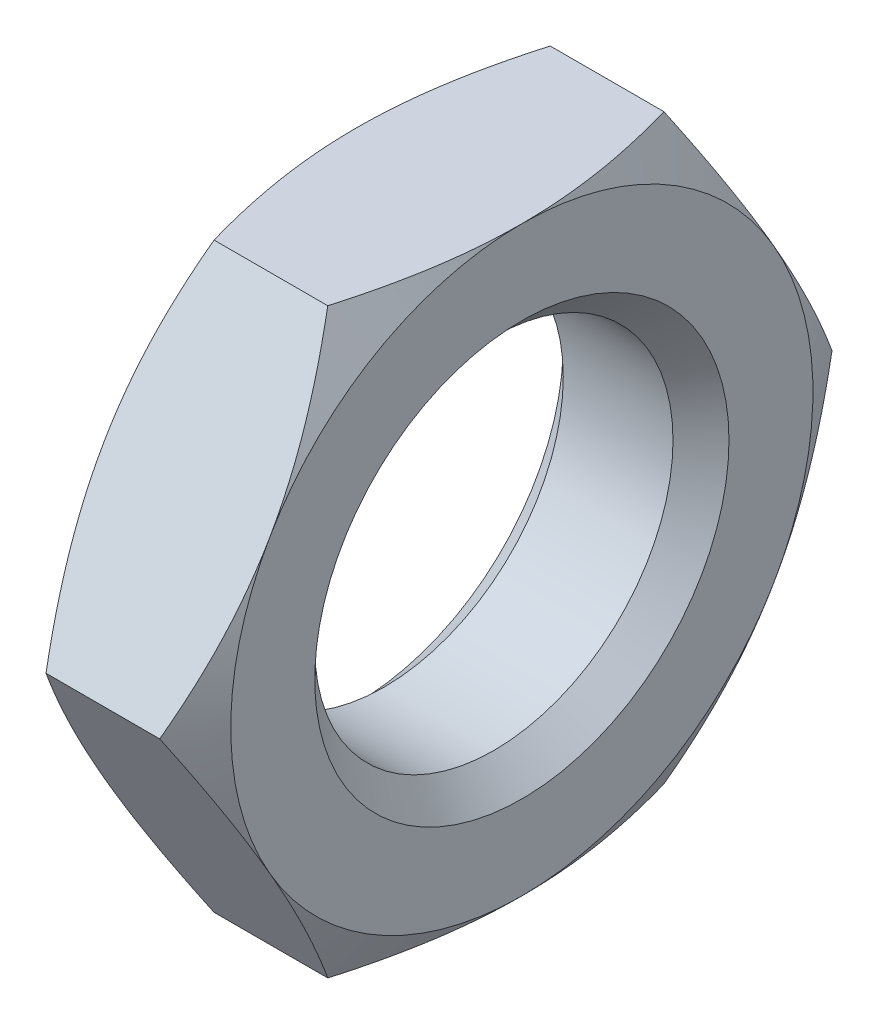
ISO-10303-21;
HEADER;
FILE_DESCRIPTION(('STEP AP214'),'2;1');
FILE_NAME('part.step','',(''),(''),'','','');
FILE_SCHEMA(('AUTOMOTIVE_DESIGN { 1 0 10303 214 1 1 1 1 }'));
ENDSEC;
DATA;
#1=APPLICATION_CONTEXT('core data for automotive mechanical design processes');
#2=APPLICATION_PROTOCOL_DEFINITION('international standard','automotive_design',2000,#1);
#3=PRODUCT_CONTEXT('',#1,'mechanical');
#4=PRODUCT('Part','Part','',(#3));
#5=PRODUCT_RELATED_PRODUCT_CATEGORY('part','',(#4));
#6=PRODUCT_DEFINITION_FORMATION('','',#4);
#7=PRODUCT_DEFINITION_CONTEXT('part definition',#1,'design');
#8=PRODUCT_DEFINITION('design','',#6,#7);
#9=PRODUCT_DEFINITION_SHAPE('','',#8);
#10=(LENGTH_UNIT() NAMED_UNIT(*) SI_UNIT(.MILLI.,.METRE.));
#11=(NAMED_UNIT(*) PLANE_ANGLE_UNIT() SI_UNIT($,.RADIAN.));
#12=(NAMED_UNIT(*) SI_UNIT($,.STERADIAN.) SOLID_ANGLE_UNIT());
#13=UNCERTAINTY_MEASURE_WITH_UNIT(LENGTH_MEASURE(1.E-05),#10,'distance_accuracy_value','');
#14=(GEOMETRIC_REPRESENTATION_CONTEXT(3) GLOBAL_UNCERTAINTY_ASSIGNED_CONTEXT((#13)) GLOBAL_UNIT_ASSIGNED_CONTEXT((#10,
#11,#12)) REPRESENTATION_CONTEXT('',''));
#15=CARTESIAN_POINT('',(0.,0.,0.));
#16=DIRECTION('',(0.,0.,1.));
#17=DIRECTION('',(1.,0.,0.));
#18=AXIS2_PLACEMENT_3D('',#15,#16,#17);
#19=CARTESIAN_POINT('',(3.7,6.5,-3.75277674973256));
#20=DIRECTION('',(1.,0.,0.));
#21=DIRECTION('',(0.,0.,-1.));
#22=AXIS2_PLACEMENT_3D('',#19,#20,#21);
#23=PLANE('',#22);
#24=CARTESIAN_POINT('',(3.7,0.,0.));
#25=DIRECTION('',(1.,0.,0.));
#26=DIRECTION('',(0.,0.,-1.));
#27=AXIS2_PLACEMENT_3D('',#24,#25,#26);
#28=CIRCLE('',#27,4.625);
#29=CARTESIAN_POINT('',(3.7,0.,-4.625));
#30=VERTEX_POINT('',#29);
#31=EDGE_CURVE('E11',#30,#30,#28,.F.);
#32=ORIENTED_EDGE('',*,*,#31,.T.);
#33=EDGE_LOOP('',(#32));
#34=FACE_BOUND('',#33,.T.);
#35=CARTESIAN_POINT('',(3.7,0.,0.));
#36=DIRECTION('',(1.,0.,0.));
#37=DIRECTION('',(0.,0.,-1.));
#38=AXIS2_PLACEMENT_3D('',#35,#36,#37);
#39=CIRCLE('',#38,6.5);
#40=CARTESIAN_POINT('',(3.7,-6.5,0.));
#41=VERTEX_POINT('',#40);
#42=CARTESIAN_POINT('',(3.7,-3.25,-5.62916512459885));
#43=VERTEX_POINT('',#42);
#44=EDGE_CURVE('E142',#41,#43,#39,.T.);
#45=ORIENTED_EDGE('',*,*,#44,.T.);
#46=CARTESIAN_POINT('',(3.7,3.25,-5.62916512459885));
#47=VERTEX_POINT('',#46);
#48=EDGE_CURVE('E130',#43,#47,#39,.T.);
#49=ORIENTED_EDGE('',*,*,#48,.T.);
#50=CARTESIAN_POINT('',(3.7,6.5,0.));
#51=VERTEX_POINT('',#50);
#52=EDGE_CURVE('E144',#47,#51,#39,.T.);
#53=ORIENTED_EDGE('',*,*,#52,.T.);
#54=CARTESIAN_POINT('',(3.7,3.25,5.62916512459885));
#55=VERTEX_POINT('',#54);
#56=EDGE_CURVE('E55',#51,#55,#39,.T.);
#57=ORIENTED_EDGE('',*,*,#56,.T.);
#58=CARTESIAN_POINT('',(3.7,-3.25,5.62916512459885));
#59=VERTEX_POINT('',#58);
#60=EDGE_CURVE('E63',#55,#59,#39,.T.);
#61=ORIENTED_EDGE('',*,*,#60,.T.);
#62=EDGE_CURVE('E166',#59,#41,#39,.T.);
#63=ORIENTED_EDGE('',*,*,#62,.T.);
#64=EDGE_LOOP('',(#45,#49,#53,#57,#61,#63));
#65=FACE_BOUND('',#64,.T.);
#66=ADVANCED_FACE('F39',(#34,#65),#23,.T.);
#67=CARTESIAN_POINT('',(0.,6.5,-3.75277674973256));
#68=DIRECTION('',(1.,0.,0.));
#69=DIRECTION('',(0.,0.,-1.));
#70=AXIS2_PLACEMENT_3D('',#67,#68,#69);
#71=PLANE('',#70);
#72=CARTESIAN_POINT('',(0.,0.,0.));
#73=DIRECTION('',(1.,0.,0.));
#74=DIRECTION('',(0.,0.,-1.));
#75=AXIS2_PLACEMENT_3D('',#72,#73,#74);
#76=CIRCLE('',#75,4.625);
#77=CARTESIAN_POINT('',(0.,0.,4.625));
#78=VERTEX_POINT('',#77);
#79=EDGE_CURVE('E164',#78,#78,#76,.T.);
#80=ORIENTED_EDGE('',*,*,#79,.T.);
#81=EDGE_LOOP('',(#80));
#82=FACE_BOUND('',#81,.T.);
#83=CARTESIAN_POINT('',(0.,0.,0.));
#84=DIRECTION('',(1.,0.,0.));
#85=DIRECTION('',(0.,0.,-1.));
#86=AXIS2_PLACEMENT_3D('',#83,#84,#85);
#87=CIRCLE('',#86,6.5);
#88=CARTESIAN_POINT('',(0.,-3.25,-5.62916512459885));
#89=VERTEX_POINT('',#88);
#90=CARTESIAN_POINT('',(0.,3.25,-5.62916512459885));
#91=VERTEX_POINT('',#90);
#92=EDGE_CURVE('E173',#89,#91,#87,.T.);
#93=ORIENTED_EDGE('',*,*,#92,.F.);
#94=CARTESIAN_POINT('',(0.,-6.5,0.));
#95=VERTEX_POINT('',#94);
#96=EDGE_CURVE('E318',#95,#89,#87,.T.);
#97=ORIENTED_EDGE('',*,*,#96,.F.);
#98=CARTESIAN_POINT('',(0.,-3.25,5.62916512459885));
#99=VERTEX_POINT('',#98);
#100=EDGE_CURVE('E321',#99,#95,#87,.T.);
#101=ORIENTED_EDGE('',*,*,#100,.F.);
#102=CARTESIAN_POINT('',(0.,3.25,5.62916512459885));
#103=VERTEX_POINT('',#102);
#104=EDGE_CURVE('E327',#103,#99,#87,.T.);
#105=ORIENTED_EDGE('',*,*,#104,.F.);
#106=CARTESIAN_POINT('',(0.,6.5,0.));
#107=VERTEX_POINT('',#106);
#108=EDGE_CURVE('E178',#107,#103,#87,.T.);
#109=ORIENTED_EDGE('',*,*,#108,.F.);
#110=EDGE_CURVE('E174',#91,#107,#87,.T.);
#111=ORIENTED_EDGE('',*,*,#110,.F.);
#112=EDGE_LOOP('',(#93,#97,#101,#105,#109,#111));
#113=FACE_BOUND('',#112,.T.);
#114=ADVANCED_FACE('F319',(#82,#113),#71,.F.);
#115=CARTESIAN_POINT('',(3.7,0.,0.));
#116=DIRECTION('',(-1.,0.,0.));
#117=DIRECTION('',(0.,0.,1.));
#118=AXIS2_PLACEMENT_3D('',#115,#116,#117);
#119=CYLINDRICAL_SURFACE('',#118,4.);
#120=CARTESIAN_POINT('',(0.625000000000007,0.,0.));
#121=DIRECTION('',(1.,0.,0.));
#122=DIRECTION('',(0.,0.,-1.));
#123=AXIS2_PLACEMENT_3D('',#120,#121,#122);
#124=CIRCLE('',#123,4.);
#125=CARTESIAN_POINT('',(0.625000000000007,0.,4.));
#126=VERTEX_POINT('',#125);
#127=EDGE_CURVE('E48',#126,#126,#124,.F.);
#128=ORIENTED_EDGE('',*,*,#127,.T.);
#129=EDGE_LOOP('',(#128));
#130=FACE_BOUND('',#129,.T.);
#131=CARTESIAN_POINT('',(3.075,0.,0.));
#132=DIRECTION('',(1.,0.,0.));
#133=DIRECTION('',(0.,0.,-1.));
#134=AXIS2_PLACEMENT_3D('',#131,#132,#133);
#135=CIRCLE('',#134,4.);
#136=CARTESIAN_POINT('',(3.075,0.,-4.));
#137=VERTEX_POINT('',#136);
#138=EDGE_CURVE('E410',#137,#137,#135,.T.);
#139=ORIENTED_EDGE('',*,*,#138,.T.);
#140=EDGE_LOOP('',(#139));
#141=FACE_BOUND('',#140,.T.);
#142=ADVANCED_FACE('F234',(#130,#141),#119,.F.);
#143=CARTESIAN_POINT('',(0.,0.,0.));
#144=DIRECTION('',(1.,0.,0.));
#145=DIRECTION('',(0.,0.,-1.));
#146=AXIS2_PLACEMENT_3D('',#143,#144,#145);
#147=CONICAL_SURFACE('',#146,6.5,1.0471975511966);
#148=CARTESIAN_POINT('',(0.580623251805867,-6.5002,-3.75266127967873));
#149=CARTESIAN_POINT('',(0.533004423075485,-6.35732254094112,-3.8351516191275));
#150=CARTESIAN_POINT('',(0.487546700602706,-6.21391236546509,-3.91794952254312));
#151=CARTESIAN_POINT('',(0.401548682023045,-5.9259273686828,-4.08421773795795));
#152=CARTESIAN_POINT('',(0.361010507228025,-5.78135207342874,-4.16768832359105));
#153=CARTESIAN_POINT('',(0.247571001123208,-5.34531134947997,-4.41943655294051));
#154=CARTESIAN_POINT('',(0.183047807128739,-5.05212471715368,-4.58870793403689));
#155=CARTESIAN_POINT('',(0.107386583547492,-4.61337625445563,-4.84201947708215));
#156=CARTESIAN_POINT('',(0.0858328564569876,-4.46912536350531,-4.92530276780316));
#157=CARTESIAN_POINT('',(0.0496903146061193,-4.17997178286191,-5.09224566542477));
#158=CARTESIAN_POINT('',(0.0351008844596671,-4.03506915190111,-5.17590523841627));
#159=CARTESIAN_POINT('',(0.0132587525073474,-3.74501222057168,-5.34336968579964));
#160=CARTESIAN_POINT('',(0.00599772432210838,-3.59985839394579,-5.427174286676));
#161=CARTESIAN_POINT('',(-0.00103969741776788,-3.30942466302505,-5.59485627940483));
#162=CARTESIAN_POINT('',(-0.00081632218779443,-3.16414476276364,-5.6787336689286));
#163=CARTESIAN_POINT('',(0.0100834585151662,-2.76612405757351,-5.90853103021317));
#164=CARTESIAN_POINT('',(0.0283818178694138,-2.51351353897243,-6.05437578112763));
#165=CARTESIAN_POINT('',(0.0864063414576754,-2.00997032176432,-6.34509659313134));
#166=CARTESIAN_POINT('',(0.126152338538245,-1.75903939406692,-6.48997163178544));
#167=CARTESIAN_POINT('',(0.22550590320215,-1.25448277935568,-6.78127752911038));
#168=CARTESIAN_POINT('',(0.285534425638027,-1.00092075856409,-6.92767163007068));
#169=CARTESIAN_POINT('',(0.421774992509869,-0.497578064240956,-7.21827667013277));
#170=CARTESIAN_POINT('',(0.497955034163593,-0.247790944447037,-7.36249133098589));
#171=CARTESIAN_POINT('',(0.580623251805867,0.000199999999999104,-7.50566896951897));
#172=B_SPLINE_CURVE_WITH_KNOTS('',3,(#148,#149,#150,#151,#152,#153,#154,#155,#156,#157,#158,
#159,#160,#161,#162,#163,#164,#165,#166,#167,#168,#169,#170,#171),.UNSPECIFIED.,.F.,.F.,(4,2,2,
2,2,2,2,2,2,2,2,4),(0.,0.515105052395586,1.03043143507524,2.06322554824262,2.56697389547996,
3.07067772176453,3.57380860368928,4.0769239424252,4.9527935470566,5.82947446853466,
6.72559912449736,7.61996451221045),.UNSPECIFIED.);
#173=CARTESIAN_POINT('',(0.580556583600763,0.,-7.50555349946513));
#174=VERTEX_POINT('',#173);
#175=EDGE_CURVE('E334',#89,#174,#172,.T.);
#176=ORIENTED_EDGE('',*,*,#175,.F.);
#177=ORIENTED_EDGE('',*,*,#92,.T.);
#178=CARTESIAN_POINT('',(0.580623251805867,-0.000200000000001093,-7.50566896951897));
#179=CARTESIAN_POINT('',(0.533004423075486,0.142677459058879,-7.4231786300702));
#180=CARTESIAN_POINT('',(0.487546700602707,0.286087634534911,-7.34038072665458));
#181=CARTESIAN_POINT('',(0.401548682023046,0.574072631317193,-7.17411251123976));
#182=CARTESIAN_POINT('',(0.361010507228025,0.718647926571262,-7.09064192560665));
#183=CARTESIAN_POINT('',(0.247571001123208,1.15468865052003,-6.83889369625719));
#184=CARTESIAN_POINT('',(0.183047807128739,1.44787528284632,-6.66962231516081));
#185=CARTESIAN_POINT('',(0.107386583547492,1.88662374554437,-6.41631077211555));
#186=CARTESIAN_POINT('',(0.0858328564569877,2.03087463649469,-6.33302748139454));
#187=CARTESIAN_POINT('',(0.0496903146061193,2.32002821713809,-6.16608458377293));
#188=CARTESIAN_POINT('',(0.0351008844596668,2.46493084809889,-6.08242501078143));
#189=CARTESIAN_POINT('',(0.0132587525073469,2.75498777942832,-5.91496056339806));
#190=CARTESIAN_POINT('',(0.00599772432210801,2.90014160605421,-5.8311559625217));
#191=CARTESIAN_POINT('',(-0.00103969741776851,3.19057533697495,-5.66347396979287));
#192=CARTESIAN_POINT('',(-0.000816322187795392,3.33585523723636,-5.5795965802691));
#193=CARTESIAN_POINT('',(0.0100834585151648,3.73387594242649,-5.34979921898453));
#194=CARTESIAN_POINT('',(0.0283818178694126,3.98648646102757,-5.20395446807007));
#195=CARTESIAN_POINT('',(0.0864063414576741,4.49002967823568,-4.91323365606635));
#196=CARTESIAN_POINT('',(0.126152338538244,4.74096060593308,-4.76835861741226));
#197=CARTESIAN_POINT('',(0.225505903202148,5.24551722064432,-4.47705272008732));
#198=CARTESIAN_POINT('',(0.285534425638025,5.49907924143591,-4.33065861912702));
#199=CARTESIAN_POINT('',(0.421774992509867,6.00242193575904,-4.04005357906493));
#200=CARTESIAN_POINT('',(0.497955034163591,6.25220905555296,-3.89583891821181));
#201=CARTESIAN_POINT('',(0.580623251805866,6.5002,-3.75266127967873));
#202=B_SPLINE_CURVE_WITH_KNOTS('',3,(#178,#179,#180,#181,#182,#183,#184,#185,#186,#187,#188,
#189,#190,#191,#192,#193,#194,#195,#196,#197,#198,#199,#200,#201),.UNSPECIFIED.,.F.,.F.,(4,2,2,
2,2,2,2,2,2,2,2,4),(0.,0.515105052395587,1.03043143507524,2.06322554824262,2.56697389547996,
3.07067772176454,3.57380860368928,4.0769239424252,4.9527935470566,5.82947446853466,
6.72559912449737,7.61996451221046),.UNSPECIFIED.);
#203=EDGE_CURVE('E215',#174,#91,#202,.T.);
#204=ORIENTED_EDGE('',*,*,#203,.F.);
#205=EDGE_LOOP('',(#176,#177,#204));
#206=FACE_BOUND('',#205,.T.);
#207=ADVANCED_FACE('F194',(#206),#147,.T.);
#208=ORIENTED_EDGE('',*,*,#96,.T.);
#209=CARTESIAN_POINT('',(0.580556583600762,-6.5,-3.75277674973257));
#210=VERTEX_POINT('',#209);
#211=EDGE_CURVE('E156',#210,#89,#172,.T.);
#212=ORIENTED_EDGE('',*,*,#211,.F.);
#213=CARTESIAN_POINT('',(3.19628465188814,-6.5,-10.1300722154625));
#214=CARTESIAN_POINT('',(3.05816932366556,-6.5,-9.84576103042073));
#215=CARTESIAN_POINT('',(2.92136397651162,-6.5,-9.56080251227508));
#216=CARTESIAN_POINT('',(2.65110898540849,-6.5,-8.98924677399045));
#217=CARTESIAN_POINT('',(2.51765986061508,-6.5,-8.70264930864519));
#218=CARTESIAN_POINT('',(2.25419223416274,-6.5,-8.12601862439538));
#219=CARTESIAN_POINT('',(2.12419593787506,-6.5,-7.83597522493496));
#220=CARTESIAN_POINT('',(1.8694570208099,-6.5,-7.25359890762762));
#221=CARTESIAN_POINT('',(1.74471415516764,-6.5,-6.96126609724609));
#222=CARTESIAN_POINT('',(1.49788206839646,-6.5,-6.36420629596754));
#223=CARTESIAN_POINT('',(1.37601415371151,-6.5,-6.05938731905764));
#224=CARTESIAN_POINT('',(1.14138213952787,-6.5,-5.4462012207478));
#225=CARTESIAN_POINT('',(1.02861905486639,-6.5,-5.13783370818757));
#226=CARTESIAN_POINT('',(0.815120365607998,-6.5,-4.51762249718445));
#227=CARTESIAN_POINT('',(0.71436083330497,-6.5,-4.20578711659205));
#228=CARTESIAN_POINT('',(0.528070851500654,-6.5,-3.57763978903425));
#229=CARTESIAN_POINT('',(0.442535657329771,-6.5,-3.26132927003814));
#230=CARTESIAN_POINT('',(0.291222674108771,-6.5,-2.62584167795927));
#231=CARTESIAN_POINT('',(0.225335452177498,-6.5,-2.30669108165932));
#232=CARTESIAN_POINT('',(0.11701860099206,-6.5,-1.66432377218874));
#233=CARTESIAN_POINT('',(0.0745866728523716,-6.5,-1.34110746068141));
#234=CARTESIAN_POINT('',(0.0313456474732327,-6.5,-0.856671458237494));
#235=CARTESIAN_POINT('',(0.0203401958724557,-6.5,-0.696322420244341));
#236=CARTESIAN_POINT('',(0.00511696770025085,-6.5,-0.375295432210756));
#237=CARTESIAN_POINT('',(0.000899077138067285,-6.5,-0.214617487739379));
#238=CARTESIAN_POINT('',(-0.000640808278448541,-6.5,0.106770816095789));
#239=CARTESIAN_POINT('',(0.00203719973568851,-6.5,0.267481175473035));
#240=CARTESIAN_POINT('',(0.0142209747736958,-6.5,0.588645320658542));
#241=CARTESIAN_POINT('',(0.0237270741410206,-6.5,0.749099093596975));
#242=CARTESIAN_POINT('',(0.0544565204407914,-6.5,1.13322948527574));
#243=CARTESIAN_POINT('',(0.0788370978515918,-6.5,1.35665895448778));
#244=CARTESIAN_POINT('',(0.139519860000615,-6.5,1.80188157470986));
#245=CARTESIAN_POINT('',(0.175823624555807,-6.5,2.02367450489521));
#246=CARTESIAN_POINT('',(0.300696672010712,-6.5,2.68633331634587));
#247=CARTESIAN_POINT('',(0.405205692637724,-6.5,3.12423643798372));
#248=CARTESIAN_POINT('',(0.586713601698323,-6.5,3.77906485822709));
#249=CARTESIAN_POINT('',(0.652190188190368,-6.5,3.99937961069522));
#250=CARTESIAN_POINT('',(0.790015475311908,-6.5,4.43787006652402));
#251=CARTESIAN_POINT('',(0.862364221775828,-6.5,4.65604575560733));
#252=CARTESIAN_POINT('',(1.01276712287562,-6.5,5.09032508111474));
#253=CARTESIAN_POINT('',(1.09081944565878,-6.5,5.30642935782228));
#254=CARTESIAN_POINT('',(1.25170405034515,-6.5,5.73684287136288));
#255=CARTESIAN_POINT('',(1.33453627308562,-6.5,5.951152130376));
#256=CARTESIAN_POINT('',(1.53718264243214,-6.5,6.46122147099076));
#257=CARTESIAN_POINT('',(1.65885082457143,-6.5,6.75624364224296));
#258=CARTESIAN_POINT('',(1.90822473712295,-6.5,7.34373305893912));
#259=CARTESIAN_POINT('',(2.03593085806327,-6.5,7.6362001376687));
#260=CARTESIAN_POINT('',(2.29615500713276,-6.5,8.21905505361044));
#261=CARTESIAN_POINT('',(2.42867406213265,-6.5,8.50944243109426));
#262=CARTESIAN_POINT('',(2.69754990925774,-6.5,9.08843829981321));
#263=CARTESIAN_POINT('',(2.83390678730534,-6.5,9.37704675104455));
#264=CARTESIAN_POINT('',(3.10988110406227,-6.5,9.95309426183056));
#265=CARTESIAN_POINT('',(3.24950201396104,-6.5,10.2405316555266));
#266=CARTESIAN_POINT('',(3.53129847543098,-6.5,10.8141526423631));
#267=CARTESIAN_POINT('',(3.67347405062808,-6.5,11.1003362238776));
#268=CARTESIAN_POINT('',(4.10310618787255,-6.5,11.9572283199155));
#269=CARTESIAN_POINT('',(4.39370760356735,-6.5,12.5263598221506));
#270=CARTESIAN_POINT('',(4.95570065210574,-6.5,13.6130689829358));
#271=CARTESIAN_POINT('',(5.2266118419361,-6.5,14.1308962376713));
#272=CARTESIAN_POINT('',(5.77213460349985,-6.5,15.1646213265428));
#273=CARTESIAN_POINT('',(6.04674631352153,-6.5,15.6805190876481));
#274=CARTESIAN_POINT('',(6.59806621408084,-6.5,16.7094755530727));
#275=CARTESIAN_POINT('',(6.87476715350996,-6.5,17.2225381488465));
#276=CARTESIAN_POINT('',(7.43037086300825,-6.5,18.2474321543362));
#277=CARTESIAN_POINT('',(7.70927350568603,-6.5,18.7592636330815));
#278=CARTESIAN_POINT('',(7.98899624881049,-6.5,19.2706434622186));
#279=B_SPLINE_CURVE_WITH_KNOTS('',3,(#213,#214,#215,#216,#217,#218,#219,#220,#221,#222,#223,
#224,#225,#226,#227,#228,#229,#230,#231,#232,#233,#234,#235,#236,#237,#238,#239,#240,#241,#242,
#243,#244,#245,#246,#247,#248,#249,#250,#251,#252,#253,#254,#255,#256,#257,#258,#259,#260,#261,
#262,#263,#264,#265,#266,#267,#268,#269,#270,#271,#272,#273,#274,#275,#276,#277,#278),
.UNSPECIFIED.,.F.,.F.,(4,2,2,2,2,2,2,2,2,2,2,2,2,2,2,2,2,2,2,2,2,2,2,2,2,2,2,2,2,2,2,2,4),(0.,
0.948261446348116,1.89666868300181,2.85015612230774,3.80359906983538,4.7883205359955,
5.77315160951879,6.75598546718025,7.7385124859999,8.71546029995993,9.69231234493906,
10.1743693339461,10.6564182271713,11.1384673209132,11.6205398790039,12.294427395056,
12.9684042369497,14.3170859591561,15.006543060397,15.6960047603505,16.3852459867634,
17.0744786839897,18.0317646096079,18.989112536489,19.9466659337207,20.9042407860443,
21.8628850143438,22.8215381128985,24.7385723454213,26.4917938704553,28.2450810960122,
29.9938377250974,31.7424939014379),.UNSPECIFIED.);
#280=EDGE_CURVE('E177',#95,#210,#279,.F.);
#281=ORIENTED_EDGE('',*,*,#280,.F.);
#282=EDGE_LOOP('',(#208,#212,#281));
#283=FACE_BOUND('',#282,.T.);
#284=ADVANCED_FACE('F352',(#283),#147,.T.);
#285=CARTESIAN_POINT('',(1.85,0.,0.));
#286=DIRECTION('',(-1.,0.,0.));
#287=DIRECTION('',(0.,0.,1.));
#288=AXIS2_PLACEMENT_3D('',#285,#286,#287);
#289=CONICAL_SURFACE('',#288,9.70429399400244,1.0471975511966);
#290=CARTESIAN_POINT('',(3.11937674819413,0.000199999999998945,-7.50566896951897));
#291=CARTESIAN_POINT('',(3.16699557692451,-0.142677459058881,-7.4231786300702));
#292=CARTESIAN_POINT('',(3.21245329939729,-0.286087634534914,-7.34038072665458));
#293=CARTESIAN_POINT('',(3.29845131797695,-0.574072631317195,-7.17411251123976));
#294=CARTESIAN_POINT('',(3.33898949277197,-0.718647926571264,-7.09064192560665));
#295=CARTESIAN_POINT('',(3.45242899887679,-1.15468865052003,-6.83889369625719));
#296=CARTESIAN_POINT('',(3.51695219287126,-1.44787528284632,-6.66962231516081));
#297=CARTESIAN_POINT('',(3.59261341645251,-1.88662374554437,-6.41631077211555));
#298=CARTESIAN_POINT('',(3.61416714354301,-2.03087463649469,-6.33302748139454));
#299=CARTESIAN_POINT('',(3.65030968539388,-2.32002821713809,-6.16608458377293));
#300=CARTESIAN_POINT('',(3.66489911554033,-2.46493084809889,-6.08242501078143));
#301=CARTESIAN_POINT('',(3.68674124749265,-2.75498777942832,-5.91496056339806));
#302=CARTESIAN_POINT('',(3.69400227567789,-2.90014160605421,-5.8311559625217));
#303=CARTESIAN_POINT('',(3.70103969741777,-3.19057533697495,-5.66347396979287));
#304=CARTESIAN_POINT('',(3.7008163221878,-3.33585523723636,-5.5795965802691));
#305=CARTESIAN_POINT('',(3.68991654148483,-3.73387594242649,-5.34979921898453));
#306=CARTESIAN_POINT('',(3.67161818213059,-3.98648646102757,-5.20395446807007));
#307=CARTESIAN_POINT('',(3.61359365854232,-4.49002967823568,-4.91323365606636));
#308=CARTESIAN_POINT('',(3.57384766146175,-4.74096060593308,-4.76835861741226));
#309=CARTESIAN_POINT('',(3.47449409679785,-5.24551722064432,-4.47705272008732));
#310=CARTESIAN_POINT('',(3.41446557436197,-5.49907924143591,-4.33065861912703));
#311=CARTESIAN_POINT('',(3.27822500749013,-6.00242193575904,-4.04005357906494));
#312=CARTESIAN_POINT('',(3.20204496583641,-6.25220905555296,-3.89583891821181));
#313=CARTESIAN_POINT('',(3.11937674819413,-6.5002,-3.75266127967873));
#314=B_SPLINE_CURVE_WITH_KNOTS('',3,(#290,#291,#292,#293,#294,#295,#296,#297,#298,#299,#300,
#301,#302,#303,#304,#305,#306,#307,#308,#309,#310,#311,#312,#313),.UNSPECIFIED.,.F.,.F.,(4,2,2,
2,2,2,2,2,2,2,2,4),(0.,0.515105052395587,1.03043143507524,2.06322554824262,2.56697389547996,
3.07067772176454,3.57380860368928,4.0769239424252,4.9527935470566,5.82947446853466,
6.72559912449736,7.61996451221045),.UNSPECIFIED.);
#315=CARTESIAN_POINT('',(3.11944341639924,-6.5,-3.75277674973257));
#316=VERTEX_POINT('',#315);
#317=EDGE_CURVE('E147',#43,#316,#314,.T.);
#318=ORIENTED_EDGE('',*,*,#317,.F.);
#319=ORIENTED_EDGE('',*,*,#44,.F.);
#320=CARTESIAN_POINT('',(0.503715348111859,-6.5,-10.1300722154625));
#321=CARTESIAN_POINT('',(0.641830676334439,-6.5,-9.84576103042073));
#322=CARTESIAN_POINT('',(0.778636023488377,-6.5,-9.56080251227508));
#323=CARTESIAN_POINT('',(1.04889101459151,-6.5,-8.98924677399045));
#324=CARTESIAN_POINT('',(1.18234013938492,-6.5,-8.70264930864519));
#325=CARTESIAN_POINT('',(1.44580776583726,-6.5,-8.12601862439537));
#326=CARTESIAN_POINT('',(1.57580406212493,-6.5,-7.83597522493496));
#327=CARTESIAN_POINT('',(1.8305429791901,-6.5,-7.25359890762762));
#328=CARTESIAN_POINT('',(1.95528584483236,-6.5,-6.96126609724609));
#329=CARTESIAN_POINT('',(2.20211793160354,-6.5,-6.36420629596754));
#330=CARTESIAN_POINT('',(2.32398584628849,-6.5,-6.05938731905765));
#331=CARTESIAN_POINT('',(2.55861786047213,-6.5,-5.4462012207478));
#332=CARTESIAN_POINT('',(2.67138094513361,-6.5,-5.13783370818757));
#333=CARTESIAN_POINT('',(2.884879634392,-6.5,-4.51762249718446));
#334=CARTESIAN_POINT('',(2.98563916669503,-6.5,-4.20578711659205));
#335=CARTESIAN_POINT('',(3.17192914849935,-6.5,-3.57763978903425));
#336=CARTESIAN_POINT('',(3.25746434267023,-6.5,-3.26132927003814));
#337=CARTESIAN_POINT('',(3.40877732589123,-6.5,-2.62584167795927));
#338=CARTESIAN_POINT('',(3.4746645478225,-6.5,-2.30669108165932));
#339=CARTESIAN_POINT('',(3.58298139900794,-6.5,-1.66432377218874));
#340=CARTESIAN_POINT('',(3.62541332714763,-6.5,-1.34110746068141));
#341=CARTESIAN_POINT('',(3.66865435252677,-6.5,-0.856671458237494));
#342=CARTESIAN_POINT('',(3.67965980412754,-6.5,-0.696322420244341));
#343=CARTESIAN_POINT('',(3.69488303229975,-6.5,-0.375295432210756));
#344=CARTESIAN_POINT('',(3.69910092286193,-6.5,-0.214617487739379));
#345=CARTESIAN_POINT('',(3.70064080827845,-6.5,0.106770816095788));
#346=CARTESIAN_POINT('',(3.69796280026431,-6.5,0.267481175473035));
#347=CARTESIAN_POINT('',(3.6857790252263,-6.5,0.588645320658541));
#348=CARTESIAN_POINT('',(3.67627292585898,-6.5,0.749099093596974));
#349=CARTESIAN_POINT('',(3.64554347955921,-6.5,1.13322948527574));
#350=CARTESIAN_POINT('',(3.62116290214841,-6.5,1.35665895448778));
#351=CARTESIAN_POINT('',(3.56048013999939,-6.5,1.80188157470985));
#352=CARTESIAN_POINT('',(3.52417637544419,-6.5,2.0236745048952));
#353=CARTESIAN_POINT('',(3.39930332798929,-6.5,2.68633331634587));
#354=CARTESIAN_POINT('',(3.29479430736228,-6.5,3.12423643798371));
#355=CARTESIAN_POINT('',(3.11328639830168,-6.5,3.77906485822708));
#356=CARTESIAN_POINT('',(3.04780981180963,-6.5,3.99937961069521));
#357=CARTESIAN_POINT('',(2.90998452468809,-6.5,4.43787006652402));
#358=CARTESIAN_POINT('',(2.83763577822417,-6.5,4.65604575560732));
#359=CARTESIAN_POINT('',(2.68723287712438,-6.5,5.09032508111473));
#360=CARTESIAN_POINT('',(2.60918055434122,-6.5,5.30642935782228));
#361=CARTESIAN_POINT('',(2.44829594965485,-6.5,5.73684287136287));
#362=CARTESIAN_POINT('',(2.36546372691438,-6.5,5.95115213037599));
#363=CARTESIAN_POINT('',(2.16281735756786,-6.5,6.46122147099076));
#364=CARTESIAN_POINT('',(2.04114917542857,-6.5,6.75624364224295));
#365=CARTESIAN_POINT('',(1.79177526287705,-6.5,7.34373305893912));
#366=CARTESIAN_POINT('',(1.66406914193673,-6.5,7.6362001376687));
#367=CARTESIAN_POINT('',(1.40384499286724,-6.5,8.21905505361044));
#368=CARTESIAN_POINT('',(1.27132593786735,-6.5,8.50944243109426));
#369=CARTESIAN_POINT('',(1.00245009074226,-6.5,9.08843829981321));
#370=CARTESIAN_POINT('',(0.866093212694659,-6.5,9.37704675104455));
#371=CARTESIAN_POINT('',(0.590118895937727,-6.5,9.95309426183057));
#372=CARTESIAN_POINT('',(0.450497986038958,-6.5,10.2405316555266));
#373=CARTESIAN_POINT('',(0.168701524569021,-6.5,10.8141526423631));
#374=CARTESIAN_POINT('',(0.0265259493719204,-6.5,11.1003362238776));
#375=CARTESIAN_POINT('',(-0.403106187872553,-6.5,11.9572283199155));
#376=CARTESIAN_POINT('',(-0.693707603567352,-6.5,12.5263598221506));
#377=CARTESIAN_POINT('',(-1.25570065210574,-6.5,13.6130689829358));
#378=CARTESIAN_POINT('',(-1.52661184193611,-6.5,14.1308962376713));
#379=CARTESIAN_POINT('',(-2.07213460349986,-6.5,15.1646213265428));
#380=CARTESIAN_POINT('',(-2.34674631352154,-6.5,15.6805190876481));
#381=CARTESIAN_POINT('',(-2.89806621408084,-6.5,16.7094755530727));
#382=CARTESIAN_POINT('',(-3.17476715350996,-6.5,17.2225381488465));
#383=CARTESIAN_POINT('',(-3.73037086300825,-6.5,18.2474321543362));
#384=CARTESIAN_POINT('',(-4.00927350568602,-6.5,18.7592636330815));
#385=CARTESIAN_POINT('',(-4.28899624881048,-6.5,19.2706434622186));
#386=B_SPLINE_CURVE_WITH_KNOTS('',3,(#320,#321,#322,#323,#324,#325,#326,#327,#328,#329,#330,
#331,#332,#333,#334,#335,#336,#337,#338,#339,#340,#341,#342,#343,#344,#345,#346,#347,#348,#349,
#350,#351,#352,#353,#354,#355,#356,#357,#358,#359,#360,#361,#362,#363,#364,#365,#366,#367,#368,
#369,#370,#371,#372,#373,#374,#375,#376,#377,#378,#379,#380,#381,#382,#383,#384,#385),
.UNSPECIFIED.,.F.,.F.,(4,2,2,2,2,2,2,2,2,2,2,2,2,2,2,2,2,2,2,2,2,2,2,2,2,2,2,2,2,2,2,2,4),(0.,
0.948261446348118,1.89666868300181,2.85015612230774,3.80359906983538,4.78832053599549,
5.77315160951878,6.75598546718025,7.73851248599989,8.71546029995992,9.69231234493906,
10.1743693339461,10.6564182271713,11.1384673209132,11.6205398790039,12.294427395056,
12.9684042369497,14.3170859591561,15.006543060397,15.6960047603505,16.3852459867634,
17.0744786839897,18.0317646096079,18.989112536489,19.9466659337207,20.9042407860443,
21.8628850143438,22.8215381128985,24.7385723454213,26.4917938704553,28.2450810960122,
29.9938377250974,31.7424939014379),.UNSPECIFIED.);
#387=EDGE_CURVE('E151',#316,#41,#386,.T.);
#388=ORIENTED_EDGE('',*,*,#387,.F.);
#389=EDGE_LOOP('',(#318,#319,#388));
#390=FACE_BOUND('',#389,.T.);
#391=ADVANCED_FACE('F148',(#390),#289,.T.);
#392=ORIENTED_EDGE('',*,*,#48,.F.);
#393=CARTESIAN_POINT('',(3.11944341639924,0.,-7.50555349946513));
#394=VERTEX_POINT('',#393);
#395=EDGE_CURVE('E134',#394,#43,#314,.T.);
#396=ORIENTED_EDGE('',*,*,#395,.F.);
#397=CARTESIAN_POINT('',(3.11937674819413,6.5002,-3.75266127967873));
#398=CARTESIAN_POINT('',(3.16699557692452,6.35732254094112,-3.8351516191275));
#399=CARTESIAN_POINT('',(3.2124532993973,6.21391236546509,-3.91794952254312));
#400=CARTESIAN_POINT('',(3.29845131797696,5.9259273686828,-4.08421773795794));
#401=CARTESIAN_POINT('',(3.33898949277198,5.78135207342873,-4.16768832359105));
#402=CARTESIAN_POINT('',(3.45242899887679,5.34531134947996,-4.41943655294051));
#403=CARTESIAN_POINT('',(3.51695219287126,5.05212471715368,-4.58870793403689));
#404=CARTESIAN_POINT('',(3.59261341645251,4.61337625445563,-4.84201947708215));
#405=CARTESIAN_POINT('',(3.61416714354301,4.46912536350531,-4.92530276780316));
#406=CARTESIAN_POINT('',(3.65030968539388,4.17997178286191,-5.09224566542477));
#407=CARTESIAN_POINT('',(3.66489911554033,4.03506915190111,-5.17590523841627));
#408=CARTESIAN_POINT('',(3.68674124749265,3.74501222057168,-5.34336968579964));
#409=CARTESIAN_POINT('',(3.69400227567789,3.59985839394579,-5.427174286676));
#410=CARTESIAN_POINT('',(3.70103969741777,3.30942466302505,-5.59485627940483));
#411=CARTESIAN_POINT('',(3.7008163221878,3.16414476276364,-5.6787336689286));
#412=CARTESIAN_POINT('',(3.68991654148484,2.76612405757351,-5.90853103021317));
#413=CARTESIAN_POINT('',(3.67161818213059,2.51351353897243,-6.05437578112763));
#414=CARTESIAN_POINT('',(3.61359365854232,2.00997032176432,-6.34509659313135));
#415=CARTESIAN_POINT('',(3.57384766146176,1.75903939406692,-6.48997163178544));
#416=CARTESIAN_POINT('',(3.47449409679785,1.25448277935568,-6.78127752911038));
#417=CARTESIAN_POINT('',(3.41446557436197,1.00092075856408,-6.92767163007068));
#418=CARTESIAN_POINT('',(3.27822500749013,0.497578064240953,-7.21827667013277));
#419=CARTESIAN_POINT('',(3.20204496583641,0.247790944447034,-7.36249133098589));
#420=CARTESIAN_POINT('',(3.11937674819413,-0.000200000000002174,-7.50566896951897));
#421=B_SPLINE_CURVE_WITH_KNOTS('',3,(#397,#398,#399,#400,#401,#402,#403,#404,#405,#406,#407,
#408,#409,#410,#411,#412,#413,#414,#415,#416,#417,#418,#419,#420),.UNSPECIFIED.,.F.,.F.,(4,2,2,
2,2,2,2,2,2,2,2,4),(0.,0.515105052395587,1.03043143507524,2.06322554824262,2.56697389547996,
3.07067772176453,3.57380860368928,4.0769239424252,4.9527935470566,5.82947446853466,
6.72559912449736,7.61996451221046),.UNSPECIFIED.);
#422=EDGE_CURVE('E136',#47,#394,#421,.T.);
#423=ORIENTED_EDGE('',*,*,#422,.F.);
#424=EDGE_LOOP('',(#392,#396,#423));
#425=FACE_BOUND('',#424,.T.);
#426=ADVANCED_FACE('F132',(#425),#289,.T.);
#427=ORIENTED_EDGE('',*,*,#100,.T.);
#428=CARTESIAN_POINT('',(0.580556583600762,-6.5,3.75277674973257));
#429=VERTEX_POINT('',#428);
#430=EDGE_CURVE('E187',#429,#95,#279,.F.);
#431=ORIENTED_EDGE('',*,*,#430,.F.);
#432=CARTESIAN_POINT('',(0.580623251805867,0.000200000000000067,7.50566896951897));
#433=CARTESIAN_POINT('',(0.533004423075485,-0.142677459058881,7.4231786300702));
#434=CARTESIAN_POINT('',(0.487546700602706,-0.286087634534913,7.34038072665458));
#435=CARTESIAN_POINT('',(0.401548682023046,-0.574072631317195,7.17411251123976));
#436=CARTESIAN_POINT('',(0.361010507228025,-0.718647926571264,7.09064192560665));
#437=CARTESIAN_POINT('',(0.247571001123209,-1.15468865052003,6.83889369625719));
#438=CARTESIAN_POINT('',(0.18304780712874,-1.44787528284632,6.66962231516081));
#439=CARTESIAN_POINT('',(0.107386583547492,-1.88662374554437,6.41631077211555));
#440=CARTESIAN_POINT('',(0.0858328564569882,-2.03087463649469,6.33302748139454));
#441=CARTESIAN_POINT('',(0.0496903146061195,-2.32002821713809,6.16608458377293));
#442=CARTESIAN_POINT('',(0.0351008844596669,-2.46493084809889,6.08242501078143));
#443=CARTESIAN_POINT('',(0.0132587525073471,-2.75498777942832,5.91496056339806));
#444=CARTESIAN_POINT('',(0.00599772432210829,-2.90014160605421,5.8311559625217));
#445=CARTESIAN_POINT('',(-0.00103969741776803,-3.19057533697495,5.66347396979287));
#446=CARTESIAN_POINT('',(-0.000816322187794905,-3.33585523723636,5.5795965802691));
#447=CARTESIAN_POINT('',(0.0100834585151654,-3.73387594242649,5.34979921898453));
#448=CARTESIAN_POINT('',(0.0283818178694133,-3.98648646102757,5.20395446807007));
#449=CARTESIAN_POINT('',(0.086406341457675,-4.49002967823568,4.91323365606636));
#450=CARTESIAN_POINT('',(0.126152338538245,-4.74096060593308,4.76835861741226));
#451=CARTESIAN_POINT('',(0.225505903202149,-5.24551722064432,4.47705272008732));
#452=CARTESIAN_POINT('',(0.285534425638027,-5.49907924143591,4.33065861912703));
#453=CARTESIAN_POINT('',(0.421774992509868,-6.00242193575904,4.04005357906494));
#454=CARTESIAN_POINT('',(0.497955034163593,-6.25220905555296,3.89583891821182));
#455=CARTESIAN_POINT('',(0.580623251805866,-6.5002,3.75266127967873));
#456=B_SPLINE_CURVE_WITH_KNOTS('',3,(#432,#433,#434,#435,#436,#437,#438,#439,#440,#441,#442,
#443,#444,#445,#446,#447,#448,#449,#450,#451,#452,#453,#454,#455),.UNSPECIFIED.,.F.,.F.,(4,2,2,
2,2,2,2,2,2,2,2,4),(0.,0.515105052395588,1.03043143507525,2.06322554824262,2.56697389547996,
3.07067772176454,3.57380860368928,4.0769239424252,4.9527935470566,5.82947446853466,
6.72559912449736,7.61996451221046),.UNSPECIFIED.);
#457=EDGE_CURVE('E188',#99,#429,#456,.T.);
#458=ORIENTED_EDGE('',*,*,#457,.F.);
#459=EDGE_LOOP('',(#427,#431,#458));
#460=FACE_BOUND('',#459,.T.);
#461=ADVANCED_FACE('F351',(#460),#147,.T.);
#462=CARTESIAN_POINT('',(3.11944341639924,-6.5,3.75277674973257));
#463=VERTEX_POINT('',#462);
#464=EDGE_CURVE('E216',#41,#463,#386,.T.);
#465=ORIENTED_EDGE('',*,*,#464,.F.);
#466=ORIENTED_EDGE('',*,*,#62,.F.);
#467=CARTESIAN_POINT('',(3.11937674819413,-6.5002,3.75266127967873));
#468=CARTESIAN_POINT('',(3.16699557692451,-6.35732254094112,3.8351516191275));
#469=CARTESIAN_POINT('',(3.21245329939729,-6.21391236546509,3.91794952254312));
#470=CARTESIAN_POINT('',(3.29845131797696,-5.9259273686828,4.08421773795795));
#471=CARTESIAN_POINT('',(3.33898949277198,-5.78135207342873,4.16768832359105));
#472=CARTESIAN_POINT('',(3.45242899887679,-5.34531134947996,4.41943655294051));
#473=CARTESIAN_POINT('',(3.51695219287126,-5.05212471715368,4.5887079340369));
#474=CARTESIAN_POINT('',(3.59261341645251,-4.61337625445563,4.84201947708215));
#475=CARTESIAN_POINT('',(3.61416714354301,-4.46912536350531,4.92530276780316));
#476=CARTESIAN_POINT('',(3.65030968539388,-4.17997178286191,5.09224566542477));
#477=CARTESIAN_POINT('',(3.66489911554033,-4.03506915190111,5.17590523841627));
#478=CARTESIAN_POINT('',(3.68674124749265,-3.74501222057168,5.34336968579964));
#479=CARTESIAN_POINT('',(3.69400227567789,-3.59985839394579,5.427174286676));
#480=CARTESIAN_POINT('',(3.70103969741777,-3.30942466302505,5.59485627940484));
#481=CARTESIAN_POINT('',(3.7008163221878,-3.16414476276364,5.6787336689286));
#482=CARTESIAN_POINT('',(3.68991654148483,-2.76612405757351,5.90853103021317));
#483=CARTESIAN_POINT('',(3.67161818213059,-2.51351353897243,6.05437578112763));
#484=CARTESIAN_POINT('',(3.61359365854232,-2.00997032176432,6.34509659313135));
#485=CARTESIAN_POINT('',(3.57384766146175,-1.75903939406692,6.48997163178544));
#486=CARTESIAN_POINT('',(3.47449409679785,-1.25448277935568,6.78127752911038));
#487=CARTESIAN_POINT('',(3.41446557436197,-1.00092075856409,6.92767163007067));
#488=CARTESIAN_POINT('',(3.27822500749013,-0.497578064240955,7.21827667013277));
#489=CARTESIAN_POINT('',(3.20204496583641,-0.247790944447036,7.36249133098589));
#490=CARTESIAN_POINT('',(3.11937674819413,0.000199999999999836,7.50566896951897));
#491=B_SPLINE_CURVE_WITH_KNOTS('',3,(#467,#468,#469,#470,#471,#472,#473,#474,#475,#476,#477,
#478,#479,#480,#481,#482,#483,#484,#485,#486,#487,#488,#489,#490),.UNSPECIFIED.,.F.,.F.,(4,2,2,
2,2,2,2,2,2,2,2,4),(0.,0.515105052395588,1.03043143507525,2.06322554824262,2.56697389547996,
3.07067772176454,3.57380860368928,4.0769239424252,4.9527935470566,5.82947446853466,
6.72559912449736,7.61996451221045),.UNSPECIFIED.);
#492=EDGE_CURVE('E247',#463,#59,#491,.T.);
#493=ORIENTED_EDGE('',*,*,#492,.F.);
#494=EDGE_LOOP('',(#465,#466,#493));
#495=FACE_BOUND('',#494,.T.);
#496=ADVANCED_FACE('F396',(#495),#289,.T.);
#497=ORIENTED_EDGE('',*,*,#104,.T.);
#498=CARTESIAN_POINT('',(0.580556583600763,0.,7.50555349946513));
#499=VERTEX_POINT('',#498);
#500=EDGE_CURVE('E287',#499,#99,#456,.T.);
#501=ORIENTED_EDGE('',*,*,#500,.F.);
#502=CARTESIAN_POINT('',(0.580623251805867,6.5002,3.75266127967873));
#503=CARTESIAN_POINT('',(0.533004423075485,6.35732254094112,3.83515161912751));
#504=CARTESIAN_POINT('',(0.487546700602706,6.21391236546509,3.91794952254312));
#505=CARTESIAN_POINT('',(0.401548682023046,5.9259273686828,4.08421773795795));
#506=CARTESIAN_POINT('',(0.361010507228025,5.78135207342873,4.16768832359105));
#507=CARTESIAN_POINT('',(0.247571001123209,5.34531134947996,4.41943655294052));
#508=CARTESIAN_POINT('',(0.183047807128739,5.05212471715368,4.5887079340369));
#509=CARTESIAN_POINT('',(0.107386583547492,4.61337625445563,4.84201947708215));
#510=CARTESIAN_POINT('',(0.0858328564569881,4.46912536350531,4.92530276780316));
#511=CARTESIAN_POINT('',(0.0496903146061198,4.17997178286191,5.09224566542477));
#512=CARTESIAN_POINT('',(0.0351008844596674,4.03506915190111,5.17590523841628));
#513=CARTESIAN_POINT('',(0.0132587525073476,3.74501222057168,5.34336968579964));
#514=CARTESIAN_POINT('',(0.00599772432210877,3.59985839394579,5.427174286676));
#515=CARTESIAN_POINT('',(-0.00103969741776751,3.30942466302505,5.59485627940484));
#516=CARTESIAN_POINT('',(-0.000816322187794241,3.16414476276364,5.6787336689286));
#517=CARTESIAN_POINT('',(0.0100834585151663,2.76612405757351,5.90853103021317));
#518=CARTESIAN_POINT('',(0.0283818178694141,2.51351353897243,6.05437578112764));
#519=CARTESIAN_POINT('',(0.0864063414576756,2.00997032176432,6.34509659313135));
#520=CARTESIAN_POINT('',(0.126152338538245,1.75903939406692,6.48997163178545));
#521=CARTESIAN_POINT('',(0.22550590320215,1.25448277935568,6.78127752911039));
#522=CARTESIAN_POINT('',(0.285534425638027,1.00092075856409,6.92767163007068));
#523=CARTESIAN_POINT('',(0.421774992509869,0.497578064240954,7.21827667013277));
#524=CARTESIAN_POINT('',(0.497955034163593,0.247790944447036,7.36249133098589));
#525=CARTESIAN_POINT('',(0.580623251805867,-0.000200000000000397,7.50566896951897));
#526=B_SPLINE_CURVE_WITH_KNOTS('',3,(#502,#503,#504,#505,#506,#507,#508,#509,#510,#511,#512,
#513,#514,#515,#516,#517,#518,#519,#520,#521,#522,#523,#524,#525),.UNSPECIFIED.,.F.,.F.,(4,2,2,
2,2,2,2,2,2,2,2,4),(0.,0.515105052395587,1.03043143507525,2.06322554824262,2.56697389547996,
3.07067772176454,3.57380860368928,4.0769239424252,4.9527935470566,5.82947446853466,
6.72559912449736,7.61996451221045),.UNSPECIFIED.);
#527=EDGE_CURVE('E281',#103,#499,#526,.T.);
#528=ORIENTED_EDGE('',*,*,#527,.F.);
#529=EDGE_LOOP('',(#497,#501,#528));
#530=FACE_BOUND('',#529,.T.);
#531=ADVANCED_FACE('F232',(#530),#147,.T.);
#532=CARTESIAN_POINT('',(3.11944341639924,0.,7.50555349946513));
#533=VERTEX_POINT('',#532);
#534=EDGE_CURVE('E377',#59,#533,#491,.T.);
#535=ORIENTED_EDGE('',*,*,#534,.F.);
#536=ORIENTED_EDGE('',*,*,#60,.F.);
#537=CARTESIAN_POINT('',(3.11937674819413,-0.000199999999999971,7.50566896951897));
#538=CARTESIAN_POINT('',(3.16699557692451,0.14267745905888,7.4231786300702));
#539=CARTESIAN_POINT('',(3.21245329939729,0.286087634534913,7.34038072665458));
#540=CARTESIAN_POINT('',(3.29845131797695,0.574072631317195,7.17411251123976));
#541=CARTESIAN_POINT('',(3.33898949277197,0.718647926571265,7.09064192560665));
#542=CARTESIAN_POINT('',(3.45242899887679,1.15468865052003,6.83889369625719));
#543=CARTESIAN_POINT('',(3.51695219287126,1.44787528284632,6.66962231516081));
#544=CARTESIAN_POINT('',(3.59261341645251,1.88662374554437,6.41631077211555));
#545=CARTESIAN_POINT('',(3.61416714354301,2.03087463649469,6.33302748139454));
#546=CARTESIAN_POINT('',(3.65030968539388,2.32002821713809,6.16608458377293));
#547=CARTESIAN_POINT('',(3.66489911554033,2.46493084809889,6.08242501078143));
#548=CARTESIAN_POINT('',(3.68674124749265,2.75498777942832,5.91496056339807));
#549=CARTESIAN_POINT('',(3.69400227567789,2.90014160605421,5.8311559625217));
#550=CARTESIAN_POINT('',(3.70103969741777,3.19057533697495,5.66347396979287));
#551=CARTESIAN_POINT('',(3.70081632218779,3.33585523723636,5.5795965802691));
#552=CARTESIAN_POINT('',(3.68991654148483,3.73387594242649,5.34979921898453));
#553=CARTESIAN_POINT('',(3.67161818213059,3.98648646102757,5.20395446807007));
#554=CARTESIAN_POINT('',(3.61359365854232,4.49002967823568,4.91323365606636));
#555=CARTESIAN_POINT('',(3.57384766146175,4.74096060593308,4.76835861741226));
#556=CARTESIAN_POINT('',(3.47449409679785,5.24551722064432,4.47705272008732));
#557=CARTESIAN_POINT('',(3.41446557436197,5.49907924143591,4.33065861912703));
#558=CARTESIAN_POINT('',(3.27822500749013,6.00242193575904,4.04005357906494));
#559=CARTESIAN_POINT('',(3.20204496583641,6.25220905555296,3.89583891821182));
#560=CARTESIAN_POINT('',(3.11937674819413,6.5002,3.75266127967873));
#561=B_SPLINE_CURVE_WITH_KNOTS('',3,(#537,#538,#539,#540,#541,#542,#543,#544,#545,#546,#547,
#548,#549,#550,#551,#552,#553,#554,#555,#556,#557,#558,#559,#560),.UNSPECIFIED.,.F.,.F.,(4,2,2,
2,2,2,2,2,2,2,2,4),(0.,0.515105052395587,1.03043143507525,2.06322554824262,2.56697389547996,
3.07067772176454,3.57380860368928,4.0769239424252,4.9527935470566,5.82947446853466,
6.72559912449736,7.61996451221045),.UNSPECIFIED.);
#562=EDGE_CURVE('E372',#533,#55,#561,.T.);
#563=ORIENTED_EDGE('',*,*,#562,.F.);
#564=EDGE_LOOP('',(#535,#536,#563));
#565=FACE_BOUND('',#564,.T.);
#566=ADVANCED_FACE('F227',(#565),#289,.T.);
#567=ORIENTED_EDGE('',*,*,#108,.T.);
#568=CARTESIAN_POINT('',(0.580556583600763,6.5,3.75277674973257));
#569=VERTEX_POINT('',#568);
#570=EDGE_CURVE('E280',#569,#103,#526,.T.);
#571=ORIENTED_EDGE('',*,*,#570,.F.);
#572=CARTESIAN_POINT('',(3.19628465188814,6.5,-10.1300722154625));
#573=CARTESIAN_POINT('',(3.05816932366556,6.5,-9.84576103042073));
#574=CARTESIAN_POINT('',(2.92136397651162,6.5,-9.56080251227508));
#575=CARTESIAN_POINT('',(2.65110898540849,6.5,-8.98924677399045));
#576=CARTESIAN_POINT('',(2.51765986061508,6.5,-8.70264930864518));
#577=CARTESIAN_POINT('',(2.25419223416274,6.5,-8.12601862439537));
#578=CARTESIAN_POINT('',(2.12419593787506,6.5,-7.83597522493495));
#579=CARTESIAN_POINT('',(1.8694570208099,6.5,-7.25359890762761));
#580=CARTESIAN_POINT('',(1.74471415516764,6.5,-6.96126609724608));
#581=CARTESIAN_POINT('',(1.49788206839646,6.5,-6.36420629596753));
#582=CARTESIAN_POINT('',(1.37601415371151,6.5,-6.05938731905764));
#583=CARTESIAN_POINT('',(1.14138213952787,6.5,-5.44620122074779));
#584=CARTESIAN_POINT('',(1.02861905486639,6.5,-5.13783370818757));
#585=CARTESIAN_POINT('',(0.815120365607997,6.5,-4.51762249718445));
#586=CARTESIAN_POINT('',(0.714360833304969,6.5,-4.20578711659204));
#587=CARTESIAN_POINT('',(0.528070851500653,6.5,-3.57763978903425));
#588=CARTESIAN_POINT('',(0.442535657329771,6.5,-3.26132927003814));
#589=CARTESIAN_POINT('',(0.29122267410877,6.5,-2.62584167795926));
#590=CARTESIAN_POINT('',(0.225335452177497,6.5,-2.30669108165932));
#591=CARTESIAN_POINT('',(0.11701860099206,6.5,-1.66432377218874));
#592=CARTESIAN_POINT('',(0.0745866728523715,6.5,-1.34110746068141));
#593=CARTESIAN_POINT('',(0.0313456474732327,6.5,-0.856671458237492));
#594=CARTESIAN_POINT('',(0.0203401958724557,6.5,-0.696322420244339));
#595=CARTESIAN_POINT('',(0.00511696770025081,6.5,-0.375295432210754));
#596=CARTESIAN_POINT('',(0.000899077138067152,6.5,-0.214617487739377));
#597=CARTESIAN_POINT('',(-0.000640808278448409,6.5,0.106770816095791));
#598=CARTESIAN_POINT('',(0.002037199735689,6.5,0.267481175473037));
#599=CARTESIAN_POINT('',(0.0142209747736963,6.5,0.588645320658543));
#600=CARTESIAN_POINT('',(0.0237270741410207,6.5,0.749099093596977));
#601=CARTESIAN_POINT('',(0.0544565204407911,6.5,1.13322948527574));
#602=CARTESIAN_POINT('',(0.0788370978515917,6.5,1.35665895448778));
#603=CARTESIAN_POINT('',(0.139519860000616,6.5,1.80188157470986));
#604=CARTESIAN_POINT('',(0.175823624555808,6.5,2.02367450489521));
#605=CARTESIAN_POINT('',(0.300696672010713,6.5,2.68633331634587));
#606=CARTESIAN_POINT('',(0.405205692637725,6.5,3.12423643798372));
#607=CARTESIAN_POINT('',(0.586713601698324,6.5,3.77906485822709));
#608=CARTESIAN_POINT('',(0.652190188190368,6.5,3.99937961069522));
#609=CARTESIAN_POINT('',(0.790015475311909,6.5,4.43787006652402));
#610=CARTESIAN_POINT('',(0.862364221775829,6.5,4.65604575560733));
#611=CARTESIAN_POINT('',(1.01276712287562,6.5,5.09032508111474));
#612=CARTESIAN_POINT('',(1.09081944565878,6.5,5.30642935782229));
#613=CARTESIAN_POINT('',(1.25170405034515,6.5,5.73684287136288));
#614=CARTESIAN_POINT('',(1.33453627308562,6.5,5.951152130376));
#615=CARTESIAN_POINT('',(1.53718264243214,6.5,6.46122147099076));
#616=CARTESIAN_POINT('',(1.65885082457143,6.5,6.75624364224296));
#617=CARTESIAN_POINT('',(1.90822473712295,6.5,7.34373305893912));
#618=CARTESIAN_POINT('',(2.03593085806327,6.5,7.6362001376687));
#619=CARTESIAN_POINT('',(2.29615500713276,6.5,8.21905505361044));
#620=CARTESIAN_POINT('',(2.42867406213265,6.5,8.50944243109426));
#621=CARTESIAN_POINT('',(2.69754990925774,6.5,9.08843829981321));
#622=CARTESIAN_POINT('',(2.83390678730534,6.5,9.37704675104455));
#623=CARTESIAN_POINT('',(3.10988110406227,6.5,9.95309426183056));
#624=CARTESIAN_POINT('',(3.24950201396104,6.5,10.2405316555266));
#625=CARTESIAN_POINT('',(3.53129847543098,6.5,10.8141526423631));
#626=CARTESIAN_POINT('',(3.67347405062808,6.5,11.1003362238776));
#627=CARTESIAN_POINT('',(4.10310618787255,6.5,11.9572283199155));
#628=CARTESIAN_POINT('',(4.39370760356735,6.5,12.5263598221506));
#629=CARTESIAN_POINT('',(4.95570065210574,6.5,13.6130689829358));
#630=CARTESIAN_POINT('',(5.22661184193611,6.5,14.1308962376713));
#631=CARTESIAN_POINT('',(5.77213460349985,6.5,15.1646213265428));
#632=CARTESIAN_POINT('',(6.04674631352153,6.5,15.6805190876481));
#633=CARTESIAN_POINT('',(6.59806621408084,6.5,16.7094755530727));
#634=CARTESIAN_POINT('',(6.87476715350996,6.5,17.2225381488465));
#635=CARTESIAN_POINT('',(7.43037086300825,6.5,18.2474321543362));
#636=CARTESIAN_POINT('',(7.70927350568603,6.5,18.7592636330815));
#637=CARTESIAN_POINT('',(7.98899624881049,6.5,19.2706434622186));
#638=B_SPLINE_CURVE_WITH_KNOTS('',3,(#572,#573,#574,#575,#576,#577,#578,#579,#580,#581,#582,
#583,#584,#585,#586,#587,#588,#589,#590,#591,#592,#593,#594,#595,#596,#597,#598,#599,#600,#601,
#602,#603,#604,#605,#606,#607,#608,#609,#610,#611,#612,#613,#614,#615,#616,#617,#618,#619,#620,
#621,#622,#623,#624,#625,#626,#627,#628,#629,#630,#631,#632,#633,#634,#635,#636,#637),
.UNSPECIFIED.,.F.,.F.,(4,2,2,2,2,2,2,2,2,2,2,2,2,2,2,2,2,2,2,2,2,2,2,2,2,2,2,2,2,2,2,2,4),(0.,
0.948261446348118,1.89666868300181,2.85015612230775,3.80359906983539,4.7883205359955,
5.77315160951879,6.75598546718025,7.7385124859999,8.71546029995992,9.69231234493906,
10.1743693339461,10.6564182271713,11.1384673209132,11.6205398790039,12.294427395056,
12.9684042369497,14.3170859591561,15.006543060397,15.6960047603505,16.3852459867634,
17.0744786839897,18.0317646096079,18.989112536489,19.9466659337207,20.9042407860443,
21.8628850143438,22.8215381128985,24.7385723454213,26.4917938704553,28.2450810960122,
29.9938377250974,31.7424939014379),.UNSPECIFIED.);
#639=EDGE_CURVE('E273',#107,#569,#638,.T.);
#640=ORIENTED_EDGE('',*,*,#639,.F.);
#641=EDGE_LOOP('',(#567,#571,#640));
#642=FACE_BOUND('',#641,.T.);
#643=ADVANCED_FACE('F231',(#642),#147,.T.);
#644=ORIENTED_EDGE('',*,*,#56,.F.);
#645=CARTESIAN_POINT('',(0.503715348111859,6.5,-10.1300722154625));
#646=CARTESIAN_POINT('',(0.641830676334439,6.5,-9.84576103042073));
#647=CARTESIAN_POINT('',(0.778636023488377,6.5,-9.56080251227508));
#648=CARTESIAN_POINT('',(1.04889101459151,6.5,-8.98924677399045));
#649=CARTESIAN_POINT('',(1.18234013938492,6.5,-8.70264930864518));
#650=CARTESIAN_POINT('',(1.44580776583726,6.5,-8.12601862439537));
#651=CARTESIAN_POINT('',(1.57580406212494,6.5,-7.83597522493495));
#652=CARTESIAN_POINT('',(1.8305429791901,6.5,-7.25359890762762));
#653=CARTESIAN_POINT('',(1.95528584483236,6.5,-6.96126609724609));
#654=CARTESIAN_POINT('',(2.20211793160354,6.5,-6.36420629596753));
#655=CARTESIAN_POINT('',(2.32398584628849,6.5,-6.05938731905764));
#656=CARTESIAN_POINT('',(2.55861786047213,6.5,-5.4462012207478));
#657=CARTESIAN_POINT('',(2.67138094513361,6.5,-5.13783370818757));
#658=CARTESIAN_POINT('',(2.884879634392,6.5,-4.51762249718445));
#659=CARTESIAN_POINT('',(2.98563916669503,6.5,-4.20578711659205));
#660=CARTESIAN_POINT('',(3.17192914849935,6.5,-3.57763978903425));
#661=CARTESIAN_POINT('',(3.25746434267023,6.5,-3.26132927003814));
#662=CARTESIAN_POINT('',(3.40877732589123,6.5,-2.62584167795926));
#663=CARTESIAN_POINT('',(3.4746645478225,6.5,-2.30669108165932));
#664=CARTESIAN_POINT('',(3.58298139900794,6.5,-1.66432377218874));
#665=CARTESIAN_POINT('',(3.62541332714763,6.5,-1.34110746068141));
#666=CARTESIAN_POINT('',(3.66865435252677,6.5,-0.856671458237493));
#667=CARTESIAN_POINT('',(3.67965980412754,6.5,-0.69632242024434));
#668=CARTESIAN_POINT('',(3.69488303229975,6.5,-0.375295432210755));
#669=CARTESIAN_POINT('',(3.69910092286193,6.5,-0.214617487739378));
#670=CARTESIAN_POINT('',(3.70064080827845,6.5,0.10677081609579));
#671=CARTESIAN_POINT('',(3.69796280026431,6.5,0.267481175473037));
#672=CARTESIAN_POINT('',(3.6857790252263,6.5,0.588645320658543));
#673=CARTESIAN_POINT('',(3.67627292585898,6.5,0.749099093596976));
#674=CARTESIAN_POINT('',(3.64554347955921,6.5,1.13322948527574));
#675=CARTESIAN_POINT('',(3.62116290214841,6.5,1.35665895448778));
#676=CARTESIAN_POINT('',(3.56048013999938,6.5,1.80188157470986));
#677=CARTESIAN_POINT('',(3.52417637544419,6.5,2.02367450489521));
#678=CARTESIAN_POINT('',(3.39930332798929,6.5,2.68633331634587));
#679=CARTESIAN_POINT('',(3.29479430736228,6.5,3.12423643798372));
#680=CARTESIAN_POINT('',(3.11328639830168,6.5,3.77906485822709));
#681=CARTESIAN_POINT('',(3.04780981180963,6.5,3.99937961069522));
#682=CARTESIAN_POINT('',(2.90998452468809,6.5,4.43787006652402));
#683=CARTESIAN_POINT('',(2.83763577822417,6.5,4.65604575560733));
#684=CARTESIAN_POINT('',(2.68723287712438,6.5,5.09032508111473));
#685=CARTESIAN_POINT('',(2.60918055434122,6.5,5.30642935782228));
#686=CARTESIAN_POINT('',(2.44829594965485,6.5,5.73684287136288));
#687=CARTESIAN_POINT('',(2.36546372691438,6.5,5.951152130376));
#688=CARTESIAN_POINT('',(2.16281735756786,6.5,6.46122147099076));
#689=CARTESIAN_POINT('',(2.04114917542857,6.5,6.75624364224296));
#690=CARTESIAN_POINT('',(1.79177526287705,6.5,7.34373305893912));
#691=CARTESIAN_POINT('',(1.66406914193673,6.5,7.6362001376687));
#692=CARTESIAN_POINT('',(1.40384499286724,6.5,8.21905505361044));
#693=CARTESIAN_POINT('',(1.27132593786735,6.5,8.50944243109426));
#694=CARTESIAN_POINT('',(1.00245009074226,6.5,9.08843829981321));
#695=CARTESIAN_POINT('',(0.866093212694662,6.5,9.37704675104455));
#696=CARTESIAN_POINT('',(0.590118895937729,6.5,9.95309426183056));
#697=CARTESIAN_POINT('',(0.450497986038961,6.5,10.2405316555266));
#698=CARTESIAN_POINT('',(0.168701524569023,6.5,10.8141526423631));
#699=CARTESIAN_POINT('',(0.0265259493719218,6.5,11.1003362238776));
#700=CARTESIAN_POINT('',(-0.403106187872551,6.5,11.9572283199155));
#701=CARTESIAN_POINT('',(-0.69370760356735,6.5,12.5263598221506));
#702=CARTESIAN_POINT('',(-1.25570065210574,6.5,13.6130689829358));
#703=CARTESIAN_POINT('',(-1.5266118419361,6.5,14.1308962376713));
#704=CARTESIAN_POINT('',(-2.07213460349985,6.5,15.1646213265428));
#705=CARTESIAN_POINT('',(-2.34674631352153,6.5,15.6805190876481));
#706=CARTESIAN_POINT('',(-2.89806621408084,6.5,16.7094755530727));
#707=CARTESIAN_POINT('',(-3.17476715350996,6.5,17.2225381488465));
#708=CARTESIAN_POINT('',(-3.73037086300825,6.5,18.2474321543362));
#709=CARTESIAN_POINT('',(-4.00927350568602,6.5,18.7592636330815));
#710=CARTESIAN_POINT('',(-4.28899624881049,6.5,19.2706434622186));
#711=B_SPLINE_CURVE_WITH_KNOTS('',3,(#645,#646,#647,#648,#649,#650,#651,#652,#653,#654,#655,
#656,#657,#658,#659,#660,#661,#662,#663,#664,#665,#666,#667,#668,#669,#670,#671,#672,#673,#674,
#675,#676,#677,#678,#679,#680,#681,#682,#683,#684,#685,#686,#687,#688,#689,#690,#691,#692,#693,
#694,#695,#696,#697,#698,#699,#700,#701,#702,#703,#704,#705,#706,#707,#708,#709,#710),
.UNSPECIFIED.,.F.,.F.,(4,2,2,2,2,2,2,2,2,2,2,2,2,2,2,2,2,2,2,2,2,2,2,2,2,2,2,2,2,2,2,2,4),(0.,
0.948261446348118,1.89666868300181,2.85015612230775,3.80359906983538,4.78832053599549,
5.77315160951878,6.75598546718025,7.7385124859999,8.71546029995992,9.69231234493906,
10.1743693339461,10.6564182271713,11.1384673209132,11.6205398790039,12.294427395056,
12.9684042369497,14.3170859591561,15.006543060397,15.6960047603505,16.3852459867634,
17.0744786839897,18.0317646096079,18.989112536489,19.9466659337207,20.9042407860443,
21.8628850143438,22.8215381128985,24.7385723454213,26.4917938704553,28.2450810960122,
29.9938377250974,31.7424939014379),.UNSPECIFIED.);
#712=CARTESIAN_POINT('',(3.11944341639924,6.5,3.75277674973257));
#713=VERTEX_POINT('',#712);
#714=EDGE_CURVE('E258',#713,#51,#711,.F.);
#715=ORIENTED_EDGE('',*,*,#714,.F.);
#716=EDGE_CURVE('E259',#55,#713,#561,.T.);
#717=ORIENTED_EDGE('',*,*,#716,.F.);
#718=EDGE_LOOP('',(#644,#715,#717));
#719=FACE_BOUND('',#718,.T.);
#720=ADVANCED_FACE('F233',(#719),#289,.T.);
#721=ORIENTED_EDGE('',*,*,#110,.T.);
#722=CARTESIAN_POINT('',(0.580556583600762,6.5,-3.75277674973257));
#723=VERTEX_POINT('',#722);
#724=EDGE_CURVE('E279',#723,#107,#638,.T.);
#725=ORIENTED_EDGE('',*,*,#724,.F.);
#726=EDGE_CURVE('E217',#91,#723,#202,.T.);
#727=ORIENTED_EDGE('',*,*,#726,.F.);
#728=EDGE_LOOP('',(#721,#725,#727));
#729=FACE_BOUND('',#728,.T.);
#730=ADVANCED_FACE('F337',(#729),#147,.T.);
#731=ORIENTED_EDGE('',*,*,#52,.F.);
#732=CARTESIAN_POINT('',(3.11944341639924,6.5,-3.75277674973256));
#733=VERTEX_POINT('',#732);
#734=EDGE_CURVE('E385',#733,#47,#421,.T.);
#735=ORIENTED_EDGE('',*,*,#734,.F.);
#736=EDGE_CURVE('E252',#51,#733,#711,.F.);
#737=ORIENTED_EDGE('',*,*,#736,.F.);
#738=EDGE_LOOP('',(#731,#735,#737));
#739=FACE_BOUND('',#738,.T.);
#740=ADVANCED_FACE('F389',(#739),#289,.T.);
#741=CARTESIAN_POINT('',(3.7,-6.5,-3.75277674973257));
#742=DIRECTION('',(0.,0.5,0.866025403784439));
#743=DIRECTION('',(0.,-0.866025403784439,0.5));
#744=AXIS2_PLACEMENT_3D('',#741,#742,#743);
#745=PLANE('',#744);
#746=DIRECTION('',(-1.,0.,0.));
#747=VECTOR('',#746,1.);
#748=CARTESIAN_POINT('',(3.7,0.,-7.50555349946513));
#749=LINE('',#748,#747);
#750=EDGE_CURVE('E162',#394,#174,#749,.T.);
#751=ORIENTED_EDGE('',*,*,#750,.F.);
#752=ORIENTED_EDGE('',*,*,#395,.T.);
#753=ORIENTED_EDGE('',*,*,#317,.T.);
#754=DIRECTION('',(-1.,0.,0.));
#755=VECTOR('',#754,1.);
#756=CARTESIAN_POINT('',(3.7,-6.5,-3.75277674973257));
#757=LINE('',#756,#755);
#758=EDGE_CURVE('E369',#316,#210,#757,.T.);
#759=ORIENTED_EDGE('',*,*,#758,.T.);
#760=ORIENTED_EDGE('',*,*,#211,.T.);
#761=ORIENTED_EDGE('',*,*,#175,.T.);
#762=EDGE_LOOP('',(#751,#752,#753,#759,#760,#761));
#763=FACE_BOUND('',#762,.T.);
#764=ADVANCED_FACE('F159',(#763),#745,.F.);
#765=CARTESIAN_POINT('',(3.7,-6.5,3.75277674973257));
#766=DIRECTION('',(0.,1.,0.));
#767=DIRECTION('',(0.,0.,1.));
#768=AXIS2_PLACEMENT_3D('',#765,#766,#767);
#769=PLANE('',#768);
#770=ORIENTED_EDGE('',*,*,#758,.F.);
#771=ORIENTED_EDGE('',*,*,#387,.T.);
#772=ORIENTED_EDGE('',*,*,#464,.T.);
#773=DIRECTION('',(-1.,0.,0.));
#774=VECTOR('',#773,1.);
#775=CARTESIAN_POINT('',(3.7,-6.5,3.75277674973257));
#776=LINE('',#775,#774);
#777=EDGE_CURVE('E313',#463,#429,#776,.T.);
#778=ORIENTED_EDGE('',*,*,#777,.T.);
#779=ORIENTED_EDGE('',*,*,#430,.T.);
#780=ORIENTED_EDGE('',*,*,#280,.T.);
#781=EDGE_LOOP('',(#770,#771,#772,#778,#779,#780));
#782=FACE_BOUND('',#781,.T.);
#783=ADVANCED_FACE('F197',(#782),#769,.F.);
#784=CARTESIAN_POINT('',(3.7,0.,7.50555349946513));
#785=DIRECTION('',(0.,0.5,-0.866025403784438));
#786=DIRECTION('',(0.,0.866025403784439,0.5));
#787=AXIS2_PLACEMENT_3D('',#784,#785,#786);
#788=PLANE('',#787);
#789=ORIENTED_EDGE('',*,*,#777,.F.);
#790=ORIENTED_EDGE('',*,*,#492,.T.);
#791=ORIENTED_EDGE('',*,*,#534,.T.);
#792=DIRECTION('',(-1.,0.,0.));
#793=VECTOR('',#792,1.);
#794=CARTESIAN_POINT('',(3.7,0.,7.50555349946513));
#795=LINE('',#794,#793);
#796=EDGE_CURVE('E365',#533,#499,#795,.T.);
#797=ORIENTED_EDGE('',*,*,#796,.T.);
#798=ORIENTED_EDGE('',*,*,#500,.T.);
#799=ORIENTED_EDGE('',*,*,#457,.T.);
#800=EDGE_LOOP('',(#789,#790,#791,#797,#798,#799));
#801=FACE_BOUND('',#800,.T.);
#802=ADVANCED_FACE('F201',(#801),#788,.F.);
#803=CARTESIAN_POINT('',(3.7,6.5,3.75277674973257));
#804=DIRECTION('',(0.,-0.5,-0.866025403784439));
#805=DIRECTION('',(0.,0.866025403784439,-0.5));
#806=AXIS2_PLACEMENT_3D('',#803,#804,#805);
#807=PLANE('',#806);
#808=ORIENTED_EDGE('',*,*,#796,.F.);
#809=ORIENTED_EDGE('',*,*,#562,.T.);
#810=ORIENTED_EDGE('',*,*,#716,.T.);
#811=DIRECTION('',(-1.,0.,0.));
#812=VECTOR('',#811,1.);
#813=CARTESIAN_POINT('',(3.7,6.5,3.75277674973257));
#814=LINE('',#813,#812);
#815=EDGE_CURVE('E361',#713,#569,#814,.T.);
#816=ORIENTED_EDGE('',*,*,#815,.T.);
#817=ORIENTED_EDGE('',*,*,#570,.T.);
#818=ORIENTED_EDGE('',*,*,#527,.T.);
#819=EDGE_LOOP('',(#808,#809,#810,#816,#817,#818));
#820=FACE_BOUND('',#819,.T.);
#821=ADVANCED_FACE('F268',(#820),#807,.F.);
#822=CARTESIAN_POINT('',(3.7,6.5,-3.75277674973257));
#823=DIRECTION('',(0.,-1.,0.));
#824=DIRECTION('',(0.,0.,-1.));
#825=AXIS2_PLACEMENT_3D('',#822,#823,#824);
#826=PLANE('',#825);
#827=ORIENTED_EDGE('',*,*,#815,.F.);
#828=ORIENTED_EDGE('',*,*,#714,.T.);
#829=ORIENTED_EDGE('',*,*,#736,.T.);
#830=DIRECTION('',(-1.,0.,0.));
#831=VECTOR('',#830,1.);
#832=CARTESIAN_POINT('',(3.7,6.5,-3.75277674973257));
#833=LINE('',#832,#831);
#834=EDGE_CURVE('E355',#733,#723,#833,.T.);
#835=ORIENTED_EDGE('',*,*,#834,.T.);
#836=ORIENTED_EDGE('',*,*,#724,.T.);
#837=ORIENTED_EDGE('',*,*,#639,.T.);
#838=EDGE_LOOP('',(#827,#828,#829,#835,#836,#837));
#839=FACE_BOUND('',#838,.T.);
#840=ADVANCED_FACE('F264',(#839),#826,.F.);
#841=CARTESIAN_POINT('',(3.7,0.,-7.50555349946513));
#842=DIRECTION('',(0.,-0.5,0.866025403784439));
#843=DIRECTION('',(0.,-0.866025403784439,-0.5));
#844=AXIS2_PLACEMENT_3D('',#841,#842,#843);
#845=PLANE('',#844);
#846=ORIENTED_EDGE('',*,*,#834,.F.);
#847=ORIENTED_EDGE('',*,*,#734,.T.);
#848=ORIENTED_EDGE('',*,*,#422,.T.);
#849=ORIENTED_EDGE('',*,*,#750,.T.);
#850=ORIENTED_EDGE('',*,*,#203,.T.);
#851=ORIENTED_EDGE('',*,*,#726,.T.);
#852=EDGE_LOOP('',(#846,#847,#848,#849,#850,#851));
#853=FACE_BOUND('',#852,.T.);
#854=ADVANCED_FACE('F267',(#853),#845,.F.);
#855=CARTESIAN_POINT('',(0.,0.,0.));
#856=DIRECTION('',(-1.,0.,0.));
#857=DIRECTION('',(0.,0.,1.));
#858=AXIS2_PLACEMENT_3D('',#855,#856,#857);
#859=CONICAL_SURFACE('',#858,4.625,0.785398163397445);
#860=CARTESIAN_POINT('',(0.625000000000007,0.,4.));
#861=CARTESIAN_POINT('',(0.61848958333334,0.,4.00651041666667));
#862=CARTESIAN_POINT('',(0.611979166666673,0.,4.01302083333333));
#863=CARTESIAN_POINT('',(0.59895833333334,0.,4.02604166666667));
#864=CARTESIAN_POINT('',(0.592447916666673,0.,4.03255208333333));
#865=CARTESIAN_POINT('',(0.579427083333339,0.,4.04557291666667));
#866=CARTESIAN_POINT('',(0.572916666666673,0.,4.05208333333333));
#867=CARTESIAN_POINT('',(0.559895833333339,0.,4.06510416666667));
#868=CARTESIAN_POINT('',(0.553385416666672,0.,4.07161458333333));
#869=CARTESIAN_POINT('',(0.540364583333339,0.,4.08463541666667));
#870=CARTESIAN_POINT('',(0.533854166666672,0.,4.09114583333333));
#871=CARTESIAN_POINT('',(0.520833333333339,0.,4.10416666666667));
#872=CARTESIAN_POINT('',(0.514322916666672,0.,4.11067708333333));
#873=CARTESIAN_POINT('',(0.501302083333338,0.,4.12369791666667));
#874=CARTESIAN_POINT('',(0.494791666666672,0.,4.13020833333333));
#875=CARTESIAN_POINT('',(0.481770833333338,0.,4.14322916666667));
#876=CARTESIAN_POINT('',(0.475260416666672,0.,4.14973958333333));
#877=CARTESIAN_POINT('',(0.462239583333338,0.,4.16276041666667));
#878=CARTESIAN_POINT('',(0.455729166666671,0.,4.16927083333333));
#879=CARTESIAN_POINT('',(0.442708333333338,0.,4.18229166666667));
#880=CARTESIAN_POINT('',(0.436197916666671,0.,4.18880208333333));
#881=CARTESIAN_POINT('',(0.423177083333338,0.,4.20182291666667));
#882=CARTESIAN_POINT('',(0.416666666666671,0.,4.20833333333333));
#883=CARTESIAN_POINT('',(0.403645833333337,0.,4.22135416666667));
#884=CARTESIAN_POINT('',(0.397135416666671,0.,4.22786458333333));
#885=CARTESIAN_POINT('',(0.384114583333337,0.,4.24088541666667));
#886=CARTESIAN_POINT('',(0.377604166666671,0.,4.24739583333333));
#887=CARTESIAN_POINT('',(0.364583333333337,0.,4.26041666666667));
#888=CARTESIAN_POINT('',(0.35807291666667,0.,4.26692708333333));
#889=CARTESIAN_POINT('',(0.345052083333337,0.,4.27994791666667));
#890=CARTESIAN_POINT('',(0.33854166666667,0.,4.28645833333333));
#891=CARTESIAN_POINT('',(0.325520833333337,0.,4.29947916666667));
#892=CARTESIAN_POINT('',(0.31901041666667,0.,4.30598958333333));
#893=CARTESIAN_POINT('',(0.305989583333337,0.,4.31901041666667));
#894=CARTESIAN_POINT('',(0.29947916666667,0.,4.32552083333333));
#895=CARTESIAN_POINT('',(0.286458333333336,0.,4.33854166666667));
#896=CARTESIAN_POINT('',(0.27994791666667,0.,4.34505208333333));
#897=CARTESIAN_POINT('',(0.266927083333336,0.,4.35807291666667));
#898=CARTESIAN_POINT('',(0.260416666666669,0.,4.36458333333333));
#899=CARTESIAN_POINT('',(0.247395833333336,0.,4.37760416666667));
#900=CARTESIAN_POINT('',(0.240885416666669,0.,4.38411458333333));
#901=CARTESIAN_POINT('',(0.227864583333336,0.,4.39713541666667));
#902=CARTESIAN_POINT('',(0.221354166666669,0.,4.40364583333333));
#903=CARTESIAN_POINT('',(0.208333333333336,0.,4.41666666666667));
#904=CARTESIAN_POINT('',(0.201822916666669,0.,4.42317708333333));
#905=CARTESIAN_POINT('',(0.188802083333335,0.,4.43619791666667));
#906=CARTESIAN_POINT('',(0.182291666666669,0.,4.44270833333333));
#907=CARTESIAN_POINT('',(0.169270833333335,0.,4.45572916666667));
#908=CARTESIAN_POINT('',(0.162760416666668,0.,4.46223958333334));
#909=CARTESIAN_POINT('',(0.149739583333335,0.,4.47526041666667));
#910=CARTESIAN_POINT('',(0.143229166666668,0.,4.48177083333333));
#911=CARTESIAN_POINT('',(0.130208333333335,0.,4.49479166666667));
#912=CARTESIAN_POINT('',(0.123697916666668,0.,4.50130208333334));
#913=CARTESIAN_POINT('',(0.110677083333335,0.,4.51432291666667));
#914=CARTESIAN_POINT('',(0.104166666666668,0.,4.52083333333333));
#915=CARTESIAN_POINT('',(0.0911458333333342,0.,4.53385416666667));
#916=CARTESIAN_POINT('',(0.0846354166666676,0.,4.54036458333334));
#917=CARTESIAN_POINT('',(0.0716145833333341,0.,4.55338541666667));
#918=CARTESIAN_POINT('',(0.0651041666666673,0.,4.55989583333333));
#919=CARTESIAN_POINT('',(0.0520833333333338,0.,4.57291666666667));
#920=CARTESIAN_POINT('',(0.0455729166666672,0.,4.57942708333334));
#921=CARTESIAN_POINT('',(0.0325520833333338,0.,4.59244791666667));
#922=CARTESIAN_POINT('',(0.026041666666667,0.,4.59895833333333));
#923=CARTESIAN_POINT('',(0.0130208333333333,0.,4.61197916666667));
#924=CARTESIAN_POINT('',(0.00651041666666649,0.,4.61848958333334));
#925=CARTESIAN_POINT('',(0.,0.,4.625));
#926=B_SPLINE_CURVE_WITH_KNOTS('',3,(#860,#861,#862,#863,#864,#865,#866,#867,#868,#869,#870,
#871,#872,#873,#874,#875,#876,#877,#878,#879,#880,#881,#882,#883,#884,#885,#886,#887,#888,#889,
#890,#891,#892,#893,#894,#895,#896,#897,#898,#899,#900,#901,#902,#903,#904,#905,#906,#907,#908,
#909,#910,#911,#912,#913,#914,#915,#916,#917,#918,#919,#920,#921,#922,#923,#924,#925),
.UNSPECIFIED.,.F.,.F.,(4,2,2,2,2,2,2,2,2,2,2,2,2,2,2,2,2,2,2,2,2,2,2,2,2,2,2,2,2,2,2,2,4),(0.,
0.0276213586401,0.0552427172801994,0.0828640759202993,0.110485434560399,0.138106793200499,
0.165728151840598,0.193349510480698,0.220970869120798,0.248592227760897,0.276213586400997,
0.303834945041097,0.331456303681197,0.359077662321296,0.386699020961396,0.414320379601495,
0.441941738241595,0.469563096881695,0.497184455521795,0.524805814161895,0.552427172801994,
0.580048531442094,0.607669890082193,0.635291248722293,0.662912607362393,0.690533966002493,
0.718155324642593,0.745776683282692,0.773398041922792,0.801019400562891,0.828640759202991,
0.856262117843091,0.883883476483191),.UNSPECIFIED.);
#927=EDGE_CURVE('BSEAM407',#126,#78,#926,.T.);
#928=ORIENTED_EDGE('',*,*,#127,.F.);
#929=ORIENTED_EDGE('',*,*,#79,.F.);
#930=ORIENTED_EDGE('',*,*,#927,.T.);
#931=ORIENTED_EDGE('',*,*,#927,.F.);
#932=EDGE_LOOP('',(#928,#930,#929,#931));
#933=FACE_BOUND('',#932,.T.);
#934=ADVANCED_FACE('F407',(#933),#859,.F.);
#935=CARTESIAN_POINT('',(3.075,0.,0.));
#936=DIRECTION('',(1.,0.,0.));
#937=DIRECTION('',(0.,0.,-1.));
#938=AXIS2_PLACEMENT_3D('',#935,#936,#937);
#939=CONICAL_SURFACE('',#938,4.,0.78539816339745);
#940=ORIENTED_EDGE('',*,*,#31,.F.);
#941=EDGE_LOOP('',(#940));
#942=FACE_BOUND('',#941,.T.);
#943=ORIENTED_EDGE('',*,*,#138,.F.);
#944=EDGE_LOOP('',(#943));
#945=FACE_BOUND('',#944,.T.);
#946=ADVANCED_FACE('F41',(#942,#945),#939,.F.);
#947=CLOSED_SHELL('',(#66,#114,#142,#207,#284,#391,#426,#461,#496,#531,#566,#643,#720,#730,#740,
#764,#783,#802,#821,#840,#854,#934,#946));
#948=MANIFOLD_SOLID_BREP('B2',#947);
#949=ADVANCED_BREP_SHAPE_REPRESENTATION('',(#18,#948),#14);
#950=SHAPE_DEFINITION_REPRESENTATION(#9,#949);
ENDSEC;
END-ISO-10303-21;
